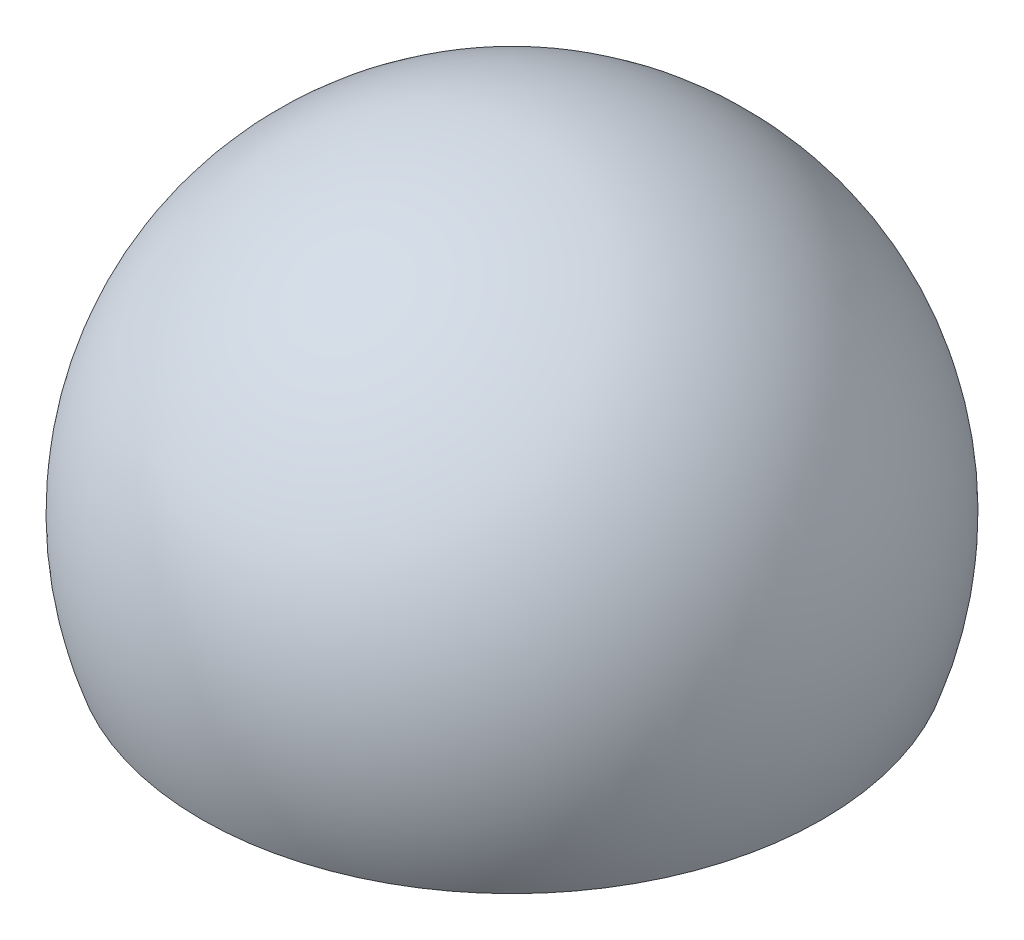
ISO-10303-21;
HEADER;
FILE_DESCRIPTION(('STEP AP214'),'2;1');
FILE_NAME('part.step','',(''),(''),'','','');
FILE_SCHEMA(('AUTOMOTIVE_DESIGN { 1 0 10303 214 1 1 1 1 }'));
ENDSEC;
DATA;
#1=APPLICATION_CONTEXT('core data for automotive mechanical design processes');
#2=APPLICATION_PROTOCOL_DEFINITION('international standard','automotive_design',2000,#1);
#3=PRODUCT_CONTEXT('',#1,'mechanical');
#4=PRODUCT('Part','Part','',(#3));
#5=PRODUCT_RELATED_PRODUCT_CATEGORY('part','',(#4));
#6=PRODUCT_DEFINITION_FORMATION('','',#4);
#7=PRODUCT_DEFINITION_CONTEXT('part definition',#1,'design');
#8=PRODUCT_DEFINITION('design','',#6,#7);
#9=PRODUCT_DEFINITION_SHAPE('','',#8);
#10=(LENGTH_UNIT() NAMED_UNIT(*) SI_UNIT(.MILLI.,.METRE.));
#11=(NAMED_UNIT(*) PLANE_ANGLE_UNIT() SI_UNIT($,.RADIAN.));
#12=(NAMED_UNIT(*) SI_UNIT($,.STERADIAN.) SOLID_ANGLE_UNIT());
#13=UNCERTAINTY_MEASURE_WITH_UNIT(LENGTH_MEASURE(1.E-05),#10,'distance_accuracy_value','');
#14=(GEOMETRIC_REPRESENTATION_CONTEXT(3) GLOBAL_UNCERTAINTY_ASSIGNED_CONTEXT((#13)) GLOBAL_UNIT_ASSIGNED_CONTEXT((#10,
#11,#12)) REPRESENTATION_CONTEXT('',''));
#15=CARTESIAN_POINT('',(0.,0.,0.));
#16=DIRECTION('',(0.,0.,1.));
#17=DIRECTION('',(1.,0.,0.));
#18=AXIS2_PLACEMENT_3D('',#15,#16,#17);
#19=CARTESIAN_POINT('',(0.,0.,0.));
#20=DIRECTION('',(0.,1.,0.));
#21=DIRECTION('',(1.,0.,0.));
#22=AXIS2_PLACEMENT_3D('',#19,#20,#21);
#23=SPHERICAL_SURFACE('',#22,6.35);
#24=CARTESIAN_POINT('',(0.,-2.1336,0.));
#25=DIRECTION('',(0.,1.,0.));
#26=DIRECTION('',(0.,0.,1.));
#27=AXIS2_PLACEMENT_3D('',#24,#25,#26);
#28=CIRCLE('',#27,5.98082360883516);
#29=CARTESIAN_POINT('',(0.,-2.1336,5.98082360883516));
#30=VERTEX_POINT('',#29);
#31=EDGE_CURVE('E36',#30,#30,#28,.T.);
#32=ORIENTED_EDGE('',*,*,#31,.T.);
#33=EDGE_LOOP('',(#32));
#34=FACE_BOUND('',#33,.T.);
#35=ADVANCED_FACE('F26',(#34),#23,.T.);
#36=CARTESIAN_POINT('',(-5.98082360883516,-2.1336,-6.35));
#37=DIRECTION('',(0.,1.,0.));
#38=DIRECTION('',(0.,0.,1.));
#39=AXIS2_PLACEMENT_3D('',#36,#37,#38);
#40=PLANE('',#39);
#41=CARTESIAN_POINT('',(0.,-2.1336,0.));
#42=DIRECTION('',(0.,-1.,0.));
#43=DIRECTION('',(0.,0.,-1.));
#44=AXIS2_PLACEMENT_3D('',#41,#42,#43);
#45=CIRCLE('',#44,4.1275);
#46=CARTESIAN_POINT('',(0.,-2.1336,-4.1275));
#47=VERTEX_POINT('',#46);
#48=EDGE_CURVE('E45',#47,#47,#45,.T.);
#49=ORIENTED_EDGE('',*,*,#48,.F.);
#50=EDGE_LOOP('',(#49));
#51=FACE_BOUND('',#50,.T.);
#52=ORIENTED_EDGE('',*,*,#31,.F.);
#53=EDGE_LOOP('',(#52));
#54=FACE_BOUND('',#53,.T.);
#55=ADVANCED_FACE('F68',(#51,#54),#40,.F.);
#56=CARTESIAN_POINT('',(0.,-2.0066,0.));
#57=DIRECTION('',(0.,-1.,0.));
#58=DIRECTION('',(0.,0.,-1.));
#59=AXIS2_PLACEMENT_3D('',#56,#57,#58);
#60=CYLINDRICAL_SURFACE('',#59,4.1275);
#61=CARTESIAN_POINT('',(0.,-2.0066,0.));
#62=DIRECTION('',(0.,-1.,0.));
#63=DIRECTION('',(0.,0.,-1.));
#64=AXIS2_PLACEMENT_3D('',#61,#62,#63);
#65=CIRCLE('',#64,4.1275);
#66=CARTESIAN_POINT('',(0.,-2.0066,-4.1275));
#67=VERTEX_POINT('',#66);
#68=EDGE_CURVE('E40',#67,#67,#65,.T.);
#69=ORIENTED_EDGE('',*,*,#68,.F.);
#70=EDGE_LOOP('',(#69));
#71=FACE_BOUND('',#70,.T.);
#72=ORIENTED_EDGE('',*,*,#48,.T.);
#73=EDGE_LOOP('',(#72));
#74=FACE_BOUND('',#73,.T.);
#75=ADVANCED_FACE('F65',(#71,#74),#60,.F.);
#76=CARTESIAN_POINT('',(0.,-2.0066,0.));
#77=DIRECTION('',(0.,-1.,0.));
#78=DIRECTION('',(0.,0.,-1.));
#79=AXIS2_PLACEMENT_3D('',#76,#77,#78);
#80=PLANE('',#79);
#81=CARTESIAN_POINT('',(0.,-2.0066,0.));
#82=DIRECTION('',(0.,-1.,0.));
#83=DIRECTION('',(0.,0.,-1.));
#84=AXIS2_PLACEMENT_3D('',#81,#82,#83);
#85=CIRCLE('',#84,3.175);
#86=CARTESIAN_POINT('',(0.,-2.0066,-3.175));
#87=VERTEX_POINT('',#86);
#88=EDGE_CURVE('E10',#87,#87,#85,.F.);
#89=ORIENTED_EDGE('',*,*,#88,.T.);
#90=EDGE_LOOP('',(#89));
#91=FACE_BOUND('',#90,.T.);
#92=ORIENTED_EDGE('',*,*,#68,.T.);
#93=EDGE_LOOP('',(#92));
#94=FACE_BOUND('',#93,.T.);
#95=ADVANCED_FACE('F56',(#91,#94),#80,.T.);
#96=CARTESIAN_POINT('',(0.,4.3434,0.));
#97=DIRECTION('',(0.,-1.,0.));
#98=DIRECTION('',(0.,0.,-1.));
#99=AXIS2_PLACEMENT_3D('',#96,#97,#98);
#100=CYLINDRICAL_SURFACE('',#99,2.4765);
#101=CARTESIAN_POINT('',(0.,-1.30810000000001,0.));
#102=DIRECTION('',(0.,-1.,0.));
#103=DIRECTION('',(0.,0.,-1.));
#104=AXIS2_PLACEMENT_3D('',#101,#102,#103);
#105=CIRCLE('',#104,2.4765);
#106=CARTESIAN_POINT('',(0.,-1.30810000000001,-2.4765));
#107=VERTEX_POINT('',#106);
#108=EDGE_CURVE('E32',#107,#107,#105,.T.);
#109=ORIENTED_EDGE('',*,*,#108,.T.);
#110=EDGE_LOOP('',(#109));
#111=FACE_BOUND('',#110,.T.);
#112=CARTESIAN_POINT('',(0.,4.3434,0.));
#113=DIRECTION('',(0.,-1.,0.));
#114=DIRECTION('',(0.,0.,-1.));
#115=AXIS2_PLACEMENT_3D('',#112,#113,#114);
#116=CIRCLE('',#115,2.4765);
#117=CARTESIAN_POINT('',(0.,4.3434,-2.4765));
#118=VERTEX_POINT('',#117);
#119=EDGE_CURVE('E48',#118,#118,#116,.T.);
#120=ORIENTED_EDGE('',*,*,#119,.F.);
#121=EDGE_LOOP('',(#120));
#122=FACE_BOUND('',#121,.T.);
#123=ADVANCED_FACE('F54',(#111,#122),#100,.F.);
#124=CARTESIAN_POINT('',(0.,4.3434,0.));
#125=DIRECTION('',(0.,-1.,0.));
#126=DIRECTION('',(0.,0.,-1.));
#127=AXIS2_PLACEMENT_3D('',#124,#125,#126);
#128=PLANE('',#127);
#129=ORIENTED_EDGE('',*,*,#119,.T.);
#130=EDGE_LOOP('',(#129));
#131=FACE_BOUND('',#130,.T.);
#132=ADVANCED_FACE('F52',(#131),#128,.T.);
#133=CARTESIAN_POINT('',(0.,-1.30810000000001,0.));
#134=DIRECTION('',(0.,-1.,0.));
#135=DIRECTION('',(0.,0.,-1.));
#136=AXIS2_PLACEMENT_3D('',#133,#134,#135);
#137=CONICAL_SURFACE('',#136,2.4765,0.785398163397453);
#138=CARTESIAN_POINT('',(0.,-2.0066,-3.175));
#139=CARTESIAN_POINT('',(0.,-1.99932395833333,-3.16772395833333));
#140=CARTESIAN_POINT('',(0.,-1.99204791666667,-3.16044791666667));
#141=CARTESIAN_POINT('',(0.,-1.97749583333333,-3.14589583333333));
#142=CARTESIAN_POINT('',(0.,-1.97021979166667,-3.13861979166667));
#143=CARTESIAN_POINT('',(0.,-1.95566770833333,-3.12406770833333));
#144=CARTESIAN_POINT('',(0.,-1.94839166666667,-3.11679166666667));
#145=CARTESIAN_POINT('',(0.,-1.93383958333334,-3.10223958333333));
#146=CARTESIAN_POINT('',(0.,-1.92656354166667,-3.09496354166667));
#147=CARTESIAN_POINT('',(0.,-1.91201145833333,-3.08041145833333));
#148=CARTESIAN_POINT('',(0.,-1.90473541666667,-3.07313541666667));
#149=CARTESIAN_POINT('',(0.,-1.89018333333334,-3.05858333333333));
#150=CARTESIAN_POINT('',(0.,-1.88290729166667,-3.05130729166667));
#151=CARTESIAN_POINT('',(0.,-1.86835520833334,-3.03675520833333));
#152=CARTESIAN_POINT('',(0.,-1.86107916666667,-3.02947916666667));
#153=CARTESIAN_POINT('',(0.,-1.84652708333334,-3.01492708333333));
#154=CARTESIAN_POINT('',(0.,-1.83925104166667,-3.00765104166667));
#155=CARTESIAN_POINT('',(0.,-1.82469895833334,-2.99309895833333));
#156=CARTESIAN_POINT('',(0.,-1.81742291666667,-2.98582291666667));
#157=CARTESIAN_POINT('',(0.,-1.80287083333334,-2.97127083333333));
#158=CARTESIAN_POINT('',(0.,-1.79559479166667,-2.96399479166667));
#159=CARTESIAN_POINT('',(0.,-1.78104270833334,-2.94944270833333));
#160=CARTESIAN_POINT('',(0.,-1.77376666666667,-2.94216666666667));
#161=CARTESIAN_POINT('',(0.,-1.75921458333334,-2.92761458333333));
#162=CARTESIAN_POINT('',(0.,-1.75193854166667,-2.92033854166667));
#163=CARTESIAN_POINT('',(0.,-1.73738645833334,-2.90578645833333));
#164=CARTESIAN_POINT('',(0.,-1.73011041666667,-2.89851041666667));
#165=CARTESIAN_POINT('',(0.,-1.71555833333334,-2.88395833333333));
#166=CARTESIAN_POINT('',(0.,-1.70828229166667,-2.87668229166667));
#167=CARTESIAN_POINT('',(0.,-1.69373020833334,-2.86213020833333));
#168=CARTESIAN_POINT('',(0.,-1.68645416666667,-2.85485416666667));
#169=CARTESIAN_POINT('',(0.,-1.67190208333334,-2.84030208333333));
#170=CARTESIAN_POINT('',(0.,-1.66462604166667,-2.83302604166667));
#171=CARTESIAN_POINT('',(0.,-1.65007395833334,-2.81847395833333));
#172=CARTESIAN_POINT('',(0.,-1.64279791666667,-2.81119791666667));
#173=CARTESIAN_POINT('',(0.,-1.62824583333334,-2.79664583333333));
#174=CARTESIAN_POINT('',(0.,-1.62096979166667,-2.78936979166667));
#175=CARTESIAN_POINT('',(0.,-1.60641770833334,-2.77481770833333));
#176=CARTESIAN_POINT('',(0.,-1.59914166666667,-2.76754166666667));
#177=CARTESIAN_POINT('',(0.,-1.58458958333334,-2.75298958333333));
#178=CARTESIAN_POINT('',(0.,-1.57731354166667,-2.74571354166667));
#179=CARTESIAN_POINT('',(0.,-1.56276145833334,-2.73116145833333));
#180=CARTESIAN_POINT('',(0.,-1.55548541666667,-2.72388541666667));
#181=CARTESIAN_POINT('',(0.,-1.54093333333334,-2.70933333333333));
#182=CARTESIAN_POINT('',(0.,-1.53365729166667,-2.70205729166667));
#183=CARTESIAN_POINT('',(0.,-1.51910520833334,-2.68750520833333));
#184=CARTESIAN_POINT('',(0.,-1.51182916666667,-2.68022916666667));
#185=CARTESIAN_POINT('',(0.,-1.49727708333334,-2.66567708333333));
#186=CARTESIAN_POINT('',(0.,-1.49000104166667,-2.65840104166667));
#187=CARTESIAN_POINT('',(0.,-1.47544895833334,-2.64384895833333));
#188=CARTESIAN_POINT('',(0.,-1.46817291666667,-2.63657291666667));
#189=CARTESIAN_POINT('',(0.,-1.45362083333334,-2.62202083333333));
#190=CARTESIAN_POINT('',(0.,-1.44634479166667,-2.61474479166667));
#191=CARTESIAN_POINT('',(0.,-1.43179270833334,-2.60019270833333));
#192=CARTESIAN_POINT('',(0.,-1.42451666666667,-2.59291666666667));
#193=CARTESIAN_POINT('',(0.,-1.40996458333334,-2.57836458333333));
#194=CARTESIAN_POINT('',(0.,-1.40268854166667,-2.57108854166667));
#195=CARTESIAN_POINT('',(0.,-1.38813645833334,-2.55653645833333));
#196=CARTESIAN_POINT('',(0.,-1.38086041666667,-2.54926041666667));
#197=CARTESIAN_POINT('',(0.,-1.36630833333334,-2.53470833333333));
#198=CARTESIAN_POINT('',(0.,-1.35903229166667,-2.52743229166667));
#199=CARTESIAN_POINT('',(0.,-1.34448020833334,-2.51288020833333));
#200=CARTESIAN_POINT('',(0.,-1.33720416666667,-2.50560416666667));
#201=CARTESIAN_POINT('',(0.,-1.32265208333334,-2.49105208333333));
#202=CARTESIAN_POINT('',(0.,-1.31537604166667,-2.48377604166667));
#203=CARTESIAN_POINT('',(0.,-1.30810000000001,-2.4765));
#204=B_SPLINE_CURVE_WITH_KNOTS('',3,(#138,#139,#140,#141,#142,#143,#144,#145,#146,#147,#148,
#149,#150,#151,#152,#153,#154,#155,#156,#157,#158,#159,#160,#161,#162,#163,#164,#165,#166,#167,
#168,#169,#170,#171,#172,#173,#174,#175,#176,#177,#178,#179,#180,#181,#182,#183,#184,#185,#186,
#187,#188,#189,#190,#191,#192,#193,#194,#195,#196,#197,#198,#199,#200,#201,#202,#203),
.UNSPECIFIED.,.F.,.F.,(4,2,2,2,2,2,2,2,2,2,2,2,2,2,2,2,2,2,2,2,2,2,2,2,2,2,2,2,2,2,2,2,4),(0.,
0.0308696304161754,0.0617392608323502,0.0926088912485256,0.123478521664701,0.154348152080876,
0.185217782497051,0.216087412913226,0.246957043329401,0.277826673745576,0.308696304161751,
0.339565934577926,0.370435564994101,0.401305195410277,0.432174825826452,0.463044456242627,
0.493914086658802,0.524783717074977,0.555653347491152,0.586522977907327,0.617392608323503,
0.648262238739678,0.679131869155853,0.710001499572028,0.740871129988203,0.771740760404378,
0.802610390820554,0.833480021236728,0.864349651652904,0.895219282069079,0.926088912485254,
0.956958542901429,0.987828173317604),.UNSPECIFIED.);
#205=EDGE_CURVE('BSEAM63',#87,#107,#204,.T.);
#206=ORIENTED_EDGE('',*,*,#88,.F.);
#207=ORIENTED_EDGE('',*,*,#108,.F.);
#208=ORIENTED_EDGE('',*,*,#205,.T.);
#209=ORIENTED_EDGE('',*,*,#205,.F.);
#210=EDGE_LOOP('',(#206,#208,#207,#209));
#211=FACE_BOUND('',#210,.T.);
#212=ADVANCED_FACE('F63',(#211),#137,.F.);
#213=CLOSED_SHELL('',(#35,#55,#75,#95,#123,#132,#212));
#214=MANIFOLD_SOLID_BREP('B2',#213);
#215=ADVANCED_BREP_SHAPE_REPRESENTATION('',(#18,#214),#14);
#216=SHAPE_DEFINITION_REPRESENTATION(#9,#215);
ENDSEC;
END-ISO-10303-21;
